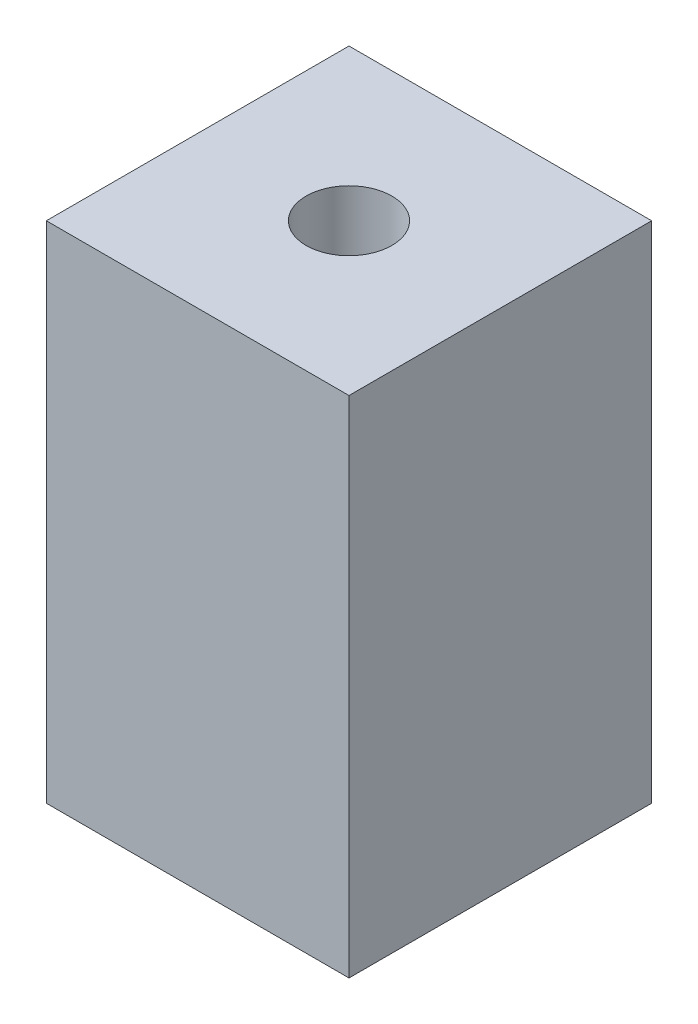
from build123d import *

# Parameters (mm, degrees)
SKETCH1_W              = 30
SKETCH1_H              = 30
BOSS_EXTRUDE1_DEPTH    = 50
M10_TAPPED_HOLE1_D     = 8.5
M10_TAPPED_HOLE1_DEPTH = 32.3
M10_TAPPED_HOLE1_TIP   = 2.553657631


with BuildPart() as part:
    # Sketch1 → Boss-Extrude1 (new body)
    with BuildSketch(Plane(origin=(0, 0, 0), x_dir=(1, 0, 0), z_dir=(0, 1, 0))):
        Rectangle(SKETCH1_W, SKETCH1_H)
    extrude(amount=BOSS_EXTRUDE1_DEPTH)

    # M10 Tapped Hole1
    with Locations(Plane(origin=(0, 50, 0), x_dir=(1, 0, 0), z_dir=(0, 1, 0))):
        with Locations((0, 0)):
            Hole(M10_TAPPED_HOLE1_D / 2, depth=M10_TAPPED_HOLE1_DEPTH)
            with Locations((0, 0, -(M10_TAPPED_HOLE1_DEPTH + M10_TAPPED_HOLE1_TIP / 2))):  # 118° drill point
                Cone(0, M10_TAPPED_HOLE1_D / 2, M10_TAPPED_HOLE1_TIP, mode=Mode.SUBTRACT)


solid = part.part
